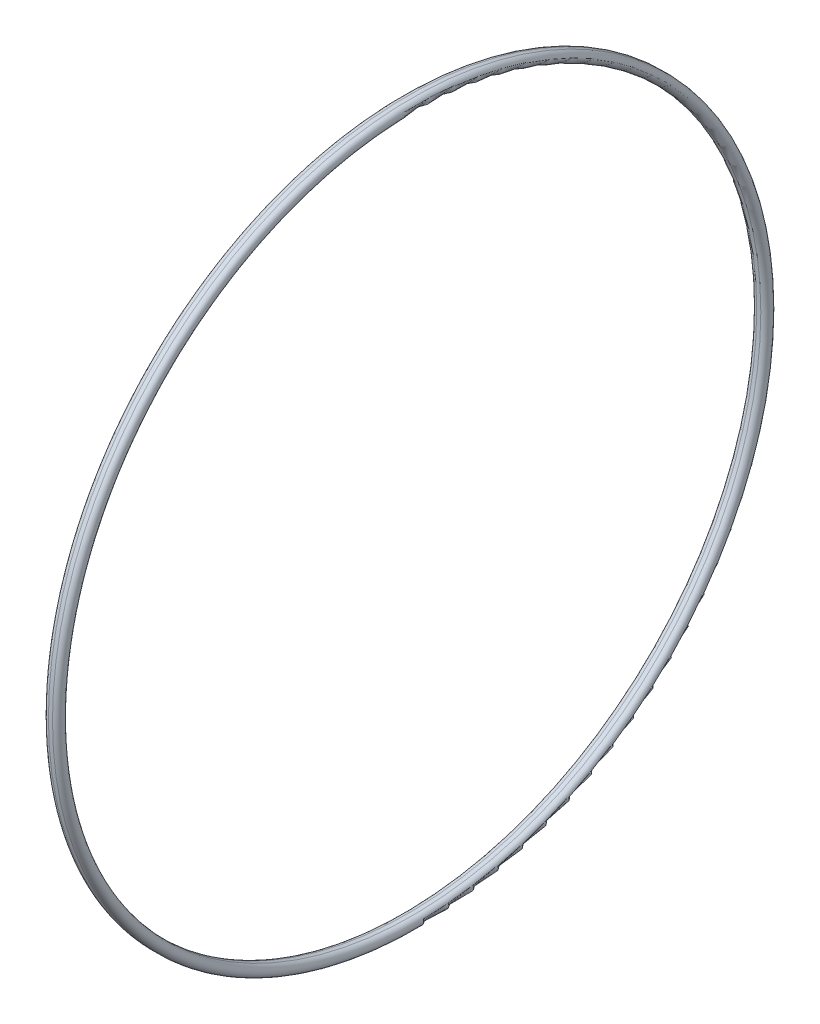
from build123d import *


with BuildPart() as part:
    # Sketch1 → Revolve1 (revolve)
    with BuildSketch(Plane.XY, mode=Mode.PRIVATE) as revolve1_sk:
        with BuildLine():
            Line((-1.0795, 184.7723), (1.0795, 184.7723))
            ThreePointArc((1.0795, 184.7723), (3.937, 187.6298), (1.0795, 190.4873))
            Line((1.0795, 190.4873), (-1.0795, 190.4873))
            ThreePointArc((-1.0795, 190.4873), (-3.937, 187.6298), (-1.0795, 184.7723))
        make_face()
    revolve(revolve1_sk.sketch.rotate(Axis((154.141395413, 0, 0), (-1, 0, 0)), 90), axis=Axis((154.141395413, 0, 0), (-1, 0, 0)))


solid = part.part
